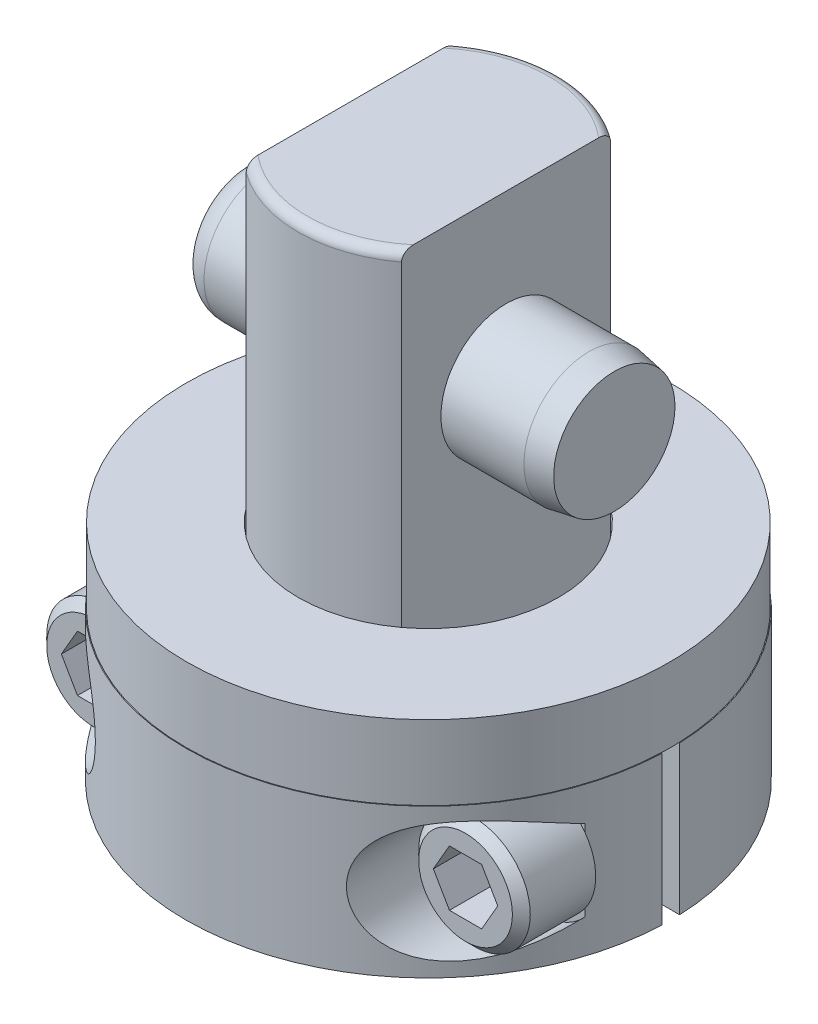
from build123d import *

# Parameters (mm, degrees)
FILLET1_R                  = 0.7874
CUT_EXTRUDE1_DEPTH         = 44.430646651
CUT_EXTRUDE1_DEPTH_BACK    = 44.430646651
SKETCH2_W                  = 4.4831
SKETCH2_H                  = 32.8676
CUT_EXTRUDE2_START         = 2.54
SKETCH3_R                  = 6.35
SKETCH3_R_2                = 5.588
CUT_EXTRUDE2_DEPTH         = 2.54
CHAMFER1_SIZE              = 0.762
SKETCH4_R                  = 5.55879
EXTRUDE1_DEPTH             = 15.875
CHAMFER2_SIZE              = 0.381
CHAMFER2_SIZE2             = 2.160758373
FILLET2_R                  = 2.286
EXTRUDE2_DEPTH             = 6.35
EXTRUDE2_DEPTH_BACK        = 6.35
CUT_EXTRUDE3_START         = 5.588
SKETCH6_R                  = 5.1562
CUT_EXTRUDE3_DEPTH         = 45.689797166
SKETCH7_R                  = 4.7625
EXTRUDE3_DEPTH             = 6.35
CHAMFER3_SIZE              = 0.762
CUT_EXTRUDE4_DEPTH         = 4.7625
EXTRUDE4_REACH             = 51.957
SKETCH10_R                 = 3.175
EXTRUDE4_DIRECTION_2_REACH = 51.957
SKETCH11_R                 = 20.6375
SKETCH11_R_2               = 11.1125
EXTRUDE5_DEPTH             = 6.35


with BuildPart() as part:
    # Sketch1 → Revolve1 (revolve)
    with BuildSketch(Plane(origin=(0, 0, 0), x_dir=(0, 0, -1), z_dir=(1, 0, 0))):
        Polygon((0, 40.4876), (11.1125, 40.4876), (11.1125, 0), (6.35, 0), (6.35, -12.7), (0, -12.7), align=None)
    revolve(axis=Axis((0, -15.35938, 0), (0, 1, 0)))

    # Fillet1
    fillet1_edges = [part.edges().sort_by_distance(p)[0] for p in [
        (0, 40.4876, 11.1125),
    ]]
    fillet(fillet1_edges, radius=FILLET1_R)

    # Sketch2 → Cut-Extrude1 (cut, two sides: drawn at the far end of the back side and taken through both)
    with BuildSketch(Plane.XY.offset(-CUT_EXTRUDE1_DEPTH_BACK)):
        with Locations((8.87095, 24.0538)):
            Rectangle(SKETCH2_W, SKETCH2_H)
        with Locations((-8.87095, 24.0538)):
            Rectangle(SKETCH2_W, SKETCH2_H)
    extrude(amount=CUT_EXTRUDE1_DEPTH + CUT_EXTRUDE1_DEPTH_BACK, mode=Mode.SUBTRACT)

    # Sketch3 → Cut-Extrude2 (cut)
    with BuildSketch(Plane.XZ.offset(CUT_EXTRUDE2_START)):
        with Locations(Location((0, 0, 0), (0, 0, 270))):
            Circle(SKETCH3_R)
        with Locations(Location((0, 0, 0), (0, 0, 270))):
            Circle(SKETCH3_R_2, mode=Mode.SUBTRACT)
    extrude(amount=-CUT_EXTRUDE2_DEPTH, mode=Mode.SUBTRACT)

    # Chamfer1
    chamfer1_edges = [part.edges().sort_by_distance(p)[0] for p in [
        (0, -12.7, 6.35),
    ]]
    chamfer(chamfer1_edges, length=CHAMFER1_SIZE)

    # Sketch4 → Extrude1 (add, symmetric)
    with BuildSketch(Plane(origin=(0, 0, 0), x_dir=(0, 0, -1), z_dir=(1, 0, 0))):
        with Locations((0, 26.6192)):
            Circle(SKETCH4_R)
    extrude(amount=EXTRUDE1_DEPTH, both=True)

    # Chamfer2
    chamfer2_edges = [part.edges().sort_by_distance(p)[0] for p in [
        (15.875, 26.6192, 5.55879),
    ]]
    chamfer2_side = [part.faces().sort_by_distance(p)[0] for p in [
        (15.875, 26.6192, 0),
    ]]
    chamfer(chamfer2_edges, length=CHAMFER2_SIZE, length2=CHAMFER2_SIZE2, reference=chamfer2_side[0])

    # Fillet2
    fillet2_edges = [part.edges().sort_by_distance(p)[0] for p in [
        (-15.875, 26.6192, 5.55879),
    ]]
    fillet(fillet2_edges, radius=FILLET2_R)

    # Sketch5 → Extrude2 (add, two sides: drawn at the far end of the back side and taken through both)
    with BuildSketch(Plane(origin=(0, 0, 0), x_dir=(1, 0, 0), z_dir=(0, 1, 0)).offset(-EXTRUDE2_DEPTH_BACK)):
        with BuildLine():
            Line((11.086343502, 0.762), (20.686970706, 0.762))
            ThreePointArc((20.686970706, 0.762), (0, 20.701), (-20.686970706, 0.762))
            Line((-20.686970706, 0.762), (-11.086343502, 0.762))
            ThreePointArc((-11.086343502, 0.762), (0, 11.1125), (11.086343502, 0.762))
        make_face()
        with BuildLine():
            Line((11.086343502, -0.762), (20.686970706, -0.762))
            ThreePointArc((20.686970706, -0.762), (0, -20.701), (-20.686970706, -0.762))
            Line((-20.686970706, -0.762), (-11.086343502, -0.762))
            ThreePointArc((-11.086343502, -0.762), (0, -11.1125), (11.086343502, -0.762))
        make_face()
    extrude(amount=EXTRUDE2_DEPTH + EXTRUDE2_DEPTH_BACK)

    # Sketch6 → Cut-Extrude3 (cut, through all)
    with BuildSketch(Plane.XY.offset(0.762).offset(CUT_EXTRUDE3_START)):
        with Locations((15.875, 0)):
            Circle(SKETCH6_R)
        with Locations((-15.875, 0)):
            Circle(SKETCH6_R)
    extrude(amount=CUT_EXTRUDE3_DEPTH, mode=Mode.SUBTRACT)

    # Sketch7 → Extrude3 (add)
    with BuildSketch(Plane.XY.offset(6.35)):
        with Locations(Location((15.875, 0, 0), (0, 0, 323.492906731))):
            Circle(SKETCH7_R)
        with Locations(Location((-15.875, 0, 0), (0, 0, 216.507093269))):
            Circle(SKETCH7_R)
    extrude(amount=EXTRUDE3_DEPTH)

    # Chamfer3
    chamfer3_edges = [part.edges().sort_by_distance(p)[0] for p in [
        (12.046982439, 2.833317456, 12.7),
        (-12.046982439, 2.833317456, 12.7),
    ]]
    chamfer(chamfer3_edges, length=CHAMFER3_SIZE)

    # Sketch8 → Cut-Extrude4 (cut)
    with BuildSketch(Plane.XY.offset(12.7)):
        Polygon((17.249815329, 2.38125), (18.624630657, 0), (17.249815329, -2.38125), (14.500184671, -2.38125), (13.125369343, 0), (14.500184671, 2.38125), align=None)
        Polygon((-18.624630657, 0), (-17.249815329, -2.38125), (-14.500184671, -2.38125), (-13.125369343, 0), (-14.500184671, 2.38125), (-17.249815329, 2.38125), align=None)
    extrude(amount=-CUT_EXTRUDE4_DEPTH, mode=Mode.SUBTRACT)

    # Sketch10 → Extrude4 (add, up to next)
    with BuildSketch(Plane.XY, mode=Mode.PRIVATE) as extrude4_sk1:
        with Locations((15.875, 0)):
            Circle(SKETCH10_R)
    extrude4_tool1 = extrude(extrude4_sk1.sketch, amount=EXTRUDE4_REACH, mode=Mode.PRIVATE) - part.part
    # Sketch10 → Extrude4 (add, up to next)
    with BuildSketch(Plane.XY, mode=Mode.PRIVATE) as extrude4_sk2:
        with Locations((-15.875, 0)):
            Circle(SKETCH10_R)
    extrude4_tool2 = extrude(extrude4_sk2.sketch, amount=EXTRUDE4_REACH, mode=Mode.PRIVATE) - part.part
    add(extrude4_tool1.solids().sort_by_distance((15.875, 0, 0))[0])
    add(extrude4_tool2.solids().sort_by_distance((-15.875, 0, 0))[0])

    # Sketch10 → Extrude4 direction 2 (add, up to next)
    with BuildSketch(Plane.XY, mode=Mode.PRIVATE) as extrude4_direction_2_sk1:
        with Locations((15.875, 0)):
            Circle(SKETCH10_R)
    extrude4_direction_2_tool1 = extrude(extrude4_direction_2_sk1.sketch, amount=-EXTRUDE4_DIRECTION_2_REACH, mode=Mode.PRIVATE) - part.part
    # Sketch10 → Extrude4 direction 2 (add, up to next)
    with BuildSketch(Plane.XY, mode=Mode.PRIVATE) as extrude4_direction_2_sk2:
        with Locations((-15.875, 0)):
            Circle(SKETCH10_R)
    extrude4_direction_2_tool2 = extrude(extrude4_direction_2_sk2.sketch, amount=-EXTRUDE4_DIRECTION_2_REACH, mode=Mode.PRIVATE) - part.part
    add(extrude4_direction_2_tool1.solids().sort_by_distance((15.875, 0, 0))[0])
    add(extrude4_direction_2_tool2.solids().sort_by_distance((-15.875, 0, 0))[0])

    # Sketch11 → Extrude5 (add)
    with BuildSketch(Plane(origin=(0, 6.35, 0), x_dir=(-1, 0, 0), z_dir=(0, 1, 0))):
        with Locations(Location((0, 0, 0), (0, 0, 182.116017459))):
            Circle(SKETCH11_R)
        Circle(SKETCH11_R_2, mode=Mode.SUBTRACT)
    extrude(amount=EXTRUDE5_DEPTH)


solid = part.part
